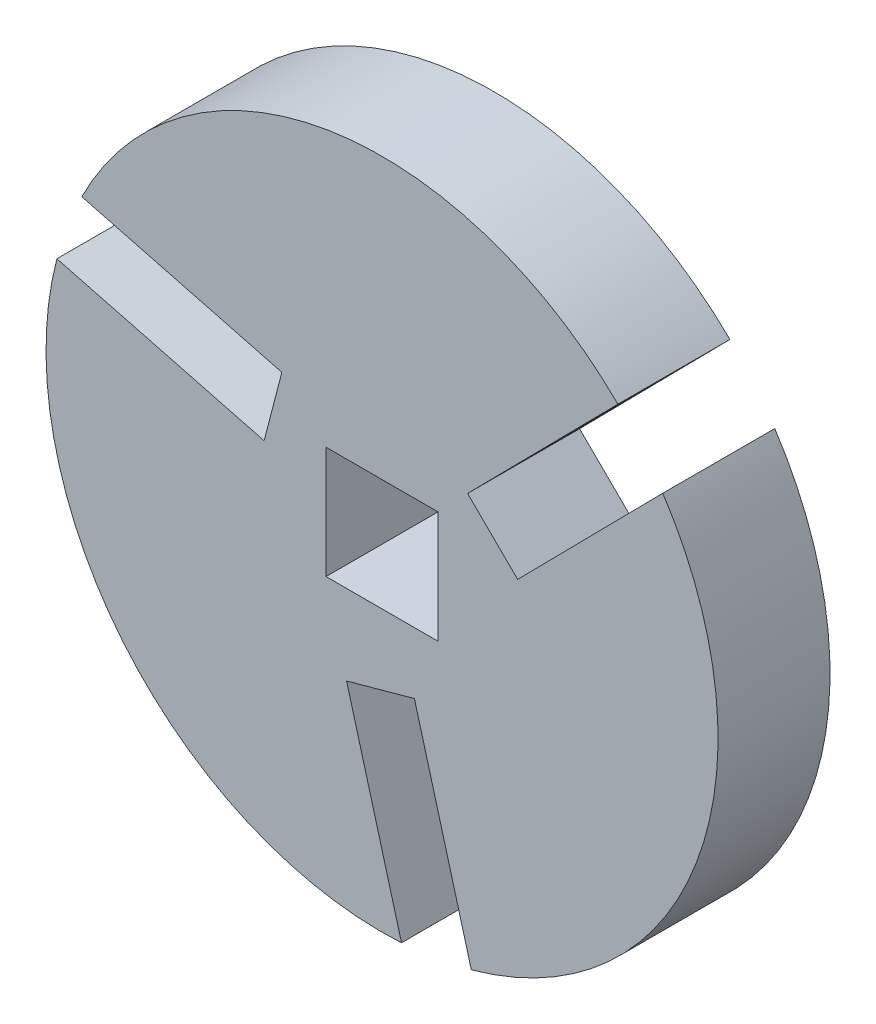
from build123d import *

# Parameters (mm, degrees)
SKETCH1_W           = 6.35
SKETCH1_H           = 6.35
BOSS_EXTRUDE1_DEPTH = 6.35


with BuildPart() as part:
    # Sketch1 → Boss-Extrude1 (new body)
    with BuildSketch(Plane.XY):
        with BuildLine():
            Line((-10.675095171, 6.900639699), (-5.680411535, 5.600275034))
            Line((-5.680411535, 5.600275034), (-6.685298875, 1.740515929))
            Line((-6.685298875, 1.740515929), (-12.290298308, 3.199776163))
            Line((-12.290298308, 3.199776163), (-18.435447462, 4.799664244))
            ThreePointArc((-18.435447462, 4.799664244), (-14.728082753, -12.082469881), (1.103832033, -19.017992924))
            Line((1.103832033, -19.017992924), (-0.64173635, -12.683776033))
            Line((-0.64173635, -12.683776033), (-2.009774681, -7.71951821))
            Line((-2.009774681, -7.71951821), (1.835318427, -6.659896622))
            Line((1.835318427, -6.659896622), (3.374061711, -12.243598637))
            Line((3.374061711, -12.243598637), (5.061092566, -18.365397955))
            ThreePointArc((5.061092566, -18.365397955), (17.827767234, -6.713658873), (15.918148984, 10.464943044))
            Line((15.918148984, 10.464943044), (11.305340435, 5.786128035))
            Line((11.305340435, 5.786128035), (7.690186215, 2.119243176))
            Line((7.690186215, 2.119243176), (4.849980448, 4.919380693))
            Line((4.849980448, 4.919380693), (8.916236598, 9.043822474))
            Line((8.916236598, 9.043822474), (13.374354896, 13.56573371))
            ThreePointArc((13.374354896, 13.56573371), (-3.09968448, 18.796128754), (-17.021981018, 8.553049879))
            Line((-17.021981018, 8.553049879), (-10.675095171, 6.900639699))
        make_face()
        Rectangle(SKETCH1_W, SKETCH1_H, mode=Mode.SUBTRACT)
    extrude(amount=BOSS_EXTRUDE1_DEPTH)


solid = part.part
